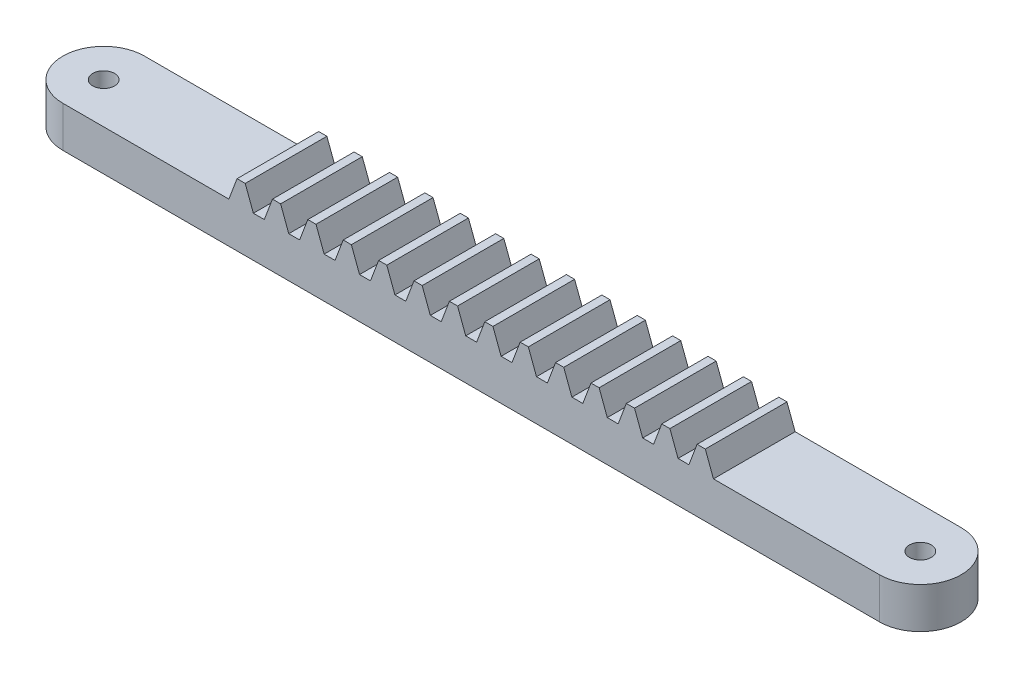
from build123d import *

# Parameters (mm, degrees)
SKETCH1_W           = 76.2
SKETCH1_H           = 3.81
BOSS_EXTRUDE1_DEPTH = 7.62
BOSS_EXTRUDE2_DEPTH = 7.62
SKETCH3_R           = 3.81
BOSS_EXTRUDE3_DEPTH = 3.81
SKETCH4_R           = 1.016
CUT_EXTRUDE1_DEPTH  = 81.462293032


with BuildPart() as part:
    # Sketch1 → Boss-Extrude1 (new body)
    with BuildSketch(Plane.XY):
        with Locations((38.1, 1.905)):
            Rectangle(SKETCH1_W, SKETCH1_H)
    extrude(amount=BOSS_EXTRUDE1_DEPTH)

    # Sketch2 → Boss-Extrude2 (add)
    with BuildSketch(Plane.XY.offset(7.62)):
        Polygon((37.592, 3.81), (36.83, 5.842), (36.068, 5.842), (35.306, 3.81), align=None)
        Polygon((32.004, 3.81), (34.29, 3.81), (33.528, 5.842), (32.766, 5.842), align=None)
        Polygon((28.702, 3.81), (30.988, 3.81), (30.226, 5.842), (29.464, 5.842), align=None)
        Polygon((25.4, 3.81), (27.686, 3.81), (26.924, 5.842), (26.162, 5.842), align=None)
        Polygon((22.098, 3.81), (24.384, 3.81), (23.622, 5.842), (22.86, 5.842), align=None)
        Polygon((18.796, 3.81), (21.082, 3.81), (20.32, 5.842), (19.558, 5.842), align=None)
        Polygon((15.494, 3.81), (17.78, 3.81), (17.018, 5.842), (16.256, 5.842), align=None)
        Polygon((59.944, 5.842), (60.706, 3.81), (58.42, 3.81), (59.182, 5.842), align=None)
        Polygon((56.642, 5.842), (57.404, 3.81), (55.118, 3.81), (55.88, 5.842), align=None)
        Polygon((53.34, 5.842), (54.102, 3.81), (51.816, 3.81), (52.578, 5.842), align=None)
        Polygon((50.038, 5.842), (50.8, 3.81), (48.514, 3.81), (49.276, 5.842), align=None)
        Polygon((46.736, 5.842), (47.498, 3.81), (45.212, 3.81), (45.974, 5.842), align=None)
        Polygon((43.434, 5.842), (44.196, 3.81), (41.91, 3.81), (42.672, 5.842), align=None)
        Polygon((40.894, 3.81), (38.608, 3.81), (39.37, 5.842), (40.132, 5.842), align=None)
    extrude(amount=-BOSS_EXTRUDE2_DEPTH)

    # Sketch3 → Boss-Extrude3 (add)
    with BuildSketch(Plane(origin=(0, 3.81, 0), x_dir=(1, 0, 0), z_dir=(0, 1, 0))):
        with Locations((0, -3.81)):
            Circle(SKETCH3_R)
        with Locations((76.2, -3.81)):
            Circle(SKETCH3_R)
    extrude(amount=-BOSS_EXTRUDE3_DEPTH)

    # Sketch4 → Cut-Extrude1 (cut, through all)
    with BuildSketch(Plane(origin=(0, 3.81, 0), x_dir=(1, 0, 0), z_dir=(0, 1, 0))):
        with Locations(Location((0, -3.81, 0), (0, 0, 270))):
            Circle(SKETCH4_R)
        with Locations(Location((76.2, -3.81, 0), (0, 0, 270))):
            Circle(SKETCH4_R)
    extrude(amount=-CUT_EXTRUDE1_DEPTH, mode=Mode.SUBTRACT)


solid = part.part
